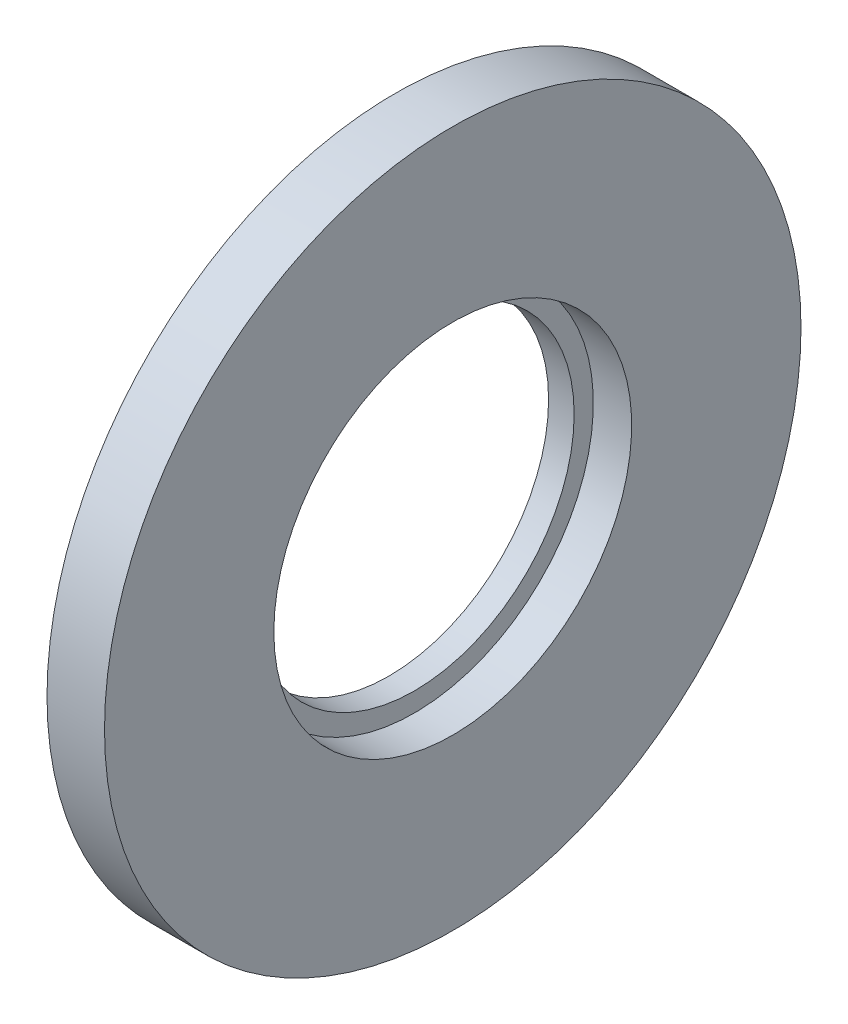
from build123d import *


with BuildPart() as part:
    # Esquisse1 → R_volution1 (revolve)
    with BuildSketch(Plane.XY, mode=Mode.PRIVATE) as r_volution1_sk:
        Polygon((0, 25), (0, 30), (1, 30), (1, 54.5), (10, 54.5), (10, 28), (4, 28), (4, 25), align=None)
    revolve(r_volution1_sk.sketch.rotate(Axis((-11.191800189, 0, 0), (1, 0, 0)), 90), axis=Axis((-11.191800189, 0, 0), (1, 0, 0)))


solid = part.part
